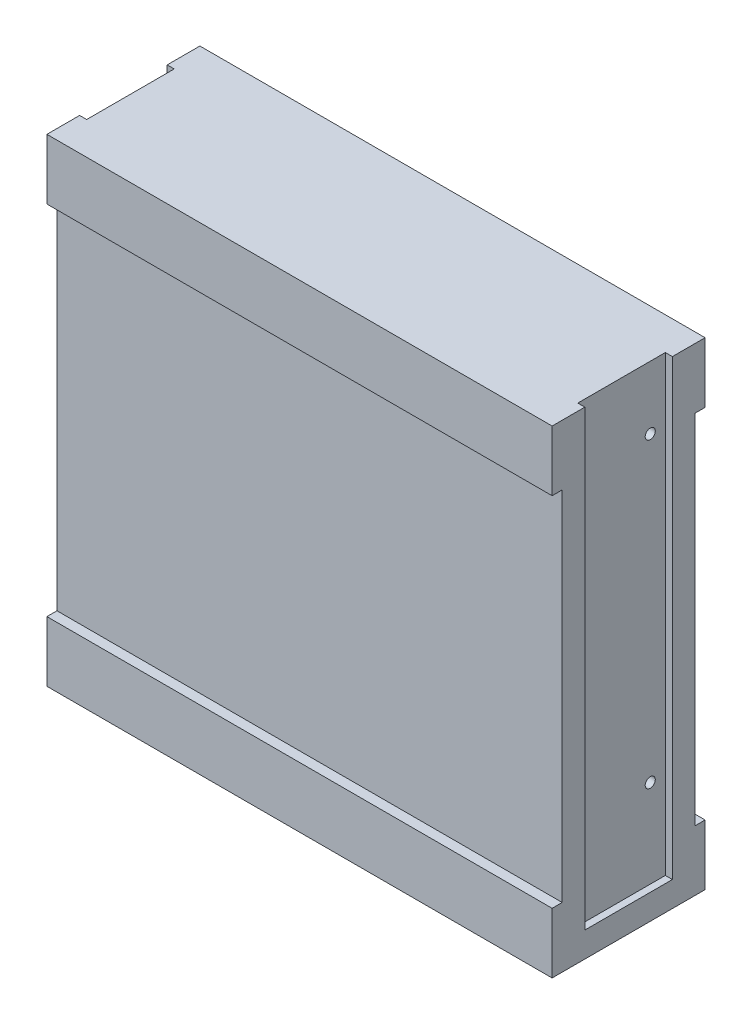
ISO-10303-21;
HEADER;
FILE_DESCRIPTION(('STEP AP214'),'2;1');
FILE_NAME('part.step','',(''),(''),'','','');
FILE_SCHEMA(('AUTOMOTIVE_DESIGN { 1 0 10303 214 1 1 1 1 }'));
ENDSEC;
DATA;
#1=APPLICATION_CONTEXT('core data for automotive mechanical design processes');
#2=APPLICATION_PROTOCOL_DEFINITION('international standard','automotive_design',2000,#1);
#3=PRODUCT_CONTEXT('',#1,'mechanical');
#4=PRODUCT('Part','Part','',(#3));
#5=PRODUCT_RELATED_PRODUCT_CATEGORY('part','',(#4));
#6=PRODUCT_DEFINITION_FORMATION('','',#4);
#7=PRODUCT_DEFINITION_CONTEXT('part definition',#1,'design');
#8=PRODUCT_DEFINITION('design','',#6,#7);
#9=PRODUCT_DEFINITION_SHAPE('','',#8);
#10=(LENGTH_UNIT() NAMED_UNIT(*) SI_UNIT(.MILLI.,.METRE.));
#11=(NAMED_UNIT(*) PLANE_ANGLE_UNIT() SI_UNIT($,.RADIAN.));
#12=(NAMED_UNIT(*) SI_UNIT($,.STERADIAN.) SOLID_ANGLE_UNIT());
#13=UNCERTAINTY_MEASURE_WITH_UNIT(LENGTH_MEASURE(1.E-05),#10,'distance_accuracy_value','');
#14=(GEOMETRIC_REPRESENTATION_CONTEXT(3) GLOBAL_UNCERTAINTY_ASSIGNED_CONTEXT((#13)) GLOBAL_UNIT_ASSIGNED_CONTEXT((#10,
#11,#12)) REPRESENTATION_CONTEXT('',''));
#15=CARTESIAN_POINT('',(0.,0.,0.));
#16=DIRECTION('',(0.,0.,1.));
#17=DIRECTION('',(1.,0.,0.));
#18=AXIS2_PLACEMENT_3D('',#15,#16,#17);
#19=CARTESIAN_POINT('',(0.,0.,0.));
#20=DIRECTION('',(0.,0.,1.));
#21=DIRECTION('',(1.,0.,0.));
#22=AXIS2_PLACEMENT_3D('',#19,#20,#21);
#23=PLANE('',#22);
#24=DIRECTION('',(0.,-1.,0.));
#25=VECTOR('',#24,1.);
#26=CARTESIAN_POINT('',(-136.451219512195,43.1006097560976,0.));
#27=LINE('',#26,#25);
#28=CARTESIAN_POINT('',(-136.451219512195,-39.8993902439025,0.));
#29=VERTEX_POINT('',#28);
#30=CARTESIAN_POINT('',(-136.451219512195,-51.8993902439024,0.));
#31=VERTEX_POINT('',#30);
#32=EDGE_CURVE('E290',#29,#31,#27,.T.);
#33=ORIENTED_EDGE('',*,*,#32,.F.);
#34=DIRECTION('',(1.,0.,0.));
#35=VECTOR('',#34,1.);
#36=CARTESIAN_POINT('',(-207.479382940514,-39.8993902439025,0.));
#37=LINE('',#36,#35);
#38=CARTESIAN_POINT('',(-36.0512195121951,-39.8993902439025,0.));
#39=VERTEX_POINT('',#38);
#40=EDGE_CURVE('E248',#29,#39,#37,.T.);
#41=ORIENTED_EDGE('',*,*,#40,.T.);
#42=DIRECTION('',(0.,1.,0.));
#43=VECTOR('',#42,1.);
#44=CARTESIAN_POINT('',(-36.0512195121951,43.1006097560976,0.));
#45=LINE('',#44,#43);
#46=CARTESIAN_POINT('',(-36.0512195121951,-51.8993902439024,0.));
#47=VERTEX_POINT('',#46);
#48=EDGE_CURVE('E310',#47,#39,#45,.T.);
#49=ORIENTED_EDGE('',*,*,#48,.F.);
#50=DIRECTION('',(1.,0.,0.));
#51=VECTOR('',#50,1.);
#52=CARTESIAN_POINT('',(-136.451219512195,-51.8993902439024,0.));
#53=LINE('',#52,#51);
#54=EDGE_CURVE('E307',#31,#47,#53,.T.);
#55=ORIENTED_EDGE('',*,*,#54,.F.);
#56=EDGE_LOOP('',(#33,#41,#49,#55));
#57=FACE_BOUND('',#56,.T.);
#58=ADVANCED_FACE('F35',(#57),#23,.F.);
#59=CARTESIAN_POINT('',(0.,0.,30.4));
#60=DIRECTION('',(0.,0.,1.));
#61=DIRECTION('',(1.,0.,0.));
#62=AXIS2_PLACEMENT_3D('',#59,#60,#61);
#63=PLANE('',#62);
#64=DIRECTION('',(1.,0.,0.));
#65=VECTOR('',#64,1.);
#66=CARTESIAN_POINT('',(-207.479382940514,31.1006097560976,30.4));
#67=LINE('',#66,#65);
#68=CARTESIAN_POINT('',(-136.451219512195,31.1006097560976,30.4));
#69=VERTEX_POINT('',#68);
#70=CARTESIAN_POINT('',(-36.0512195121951,31.1006097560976,30.4));
#71=VERTEX_POINT('',#70);
#72=EDGE_CURVE('E271',#69,#71,#67,.T.);
#73=ORIENTED_EDGE('',*,*,#72,.T.);
#74=DIRECTION('',(0.,1.,0.));
#75=VECTOR('',#74,1.);
#76=CARTESIAN_POINT('',(-36.0512195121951,43.1006097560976,30.4));
#77=LINE('',#76,#75);
#78=CARTESIAN_POINT('',(-36.0512195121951,43.1006097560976,30.4));
#79=VERTEX_POINT('',#78);
#80=EDGE_CURVE('E297',#71,#79,#77,.T.);
#81=ORIENTED_EDGE('',*,*,#80,.T.);
#82=DIRECTION('',(-1.,0.,0.));
#83=VECTOR('',#82,1.);
#84=CARTESIAN_POINT('',(-136.451219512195,43.1006097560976,30.4));
#85=LINE('',#84,#83);
#86=CARTESIAN_POINT('',(-136.451219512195,43.1006097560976,30.4));
#87=VERTEX_POINT('',#86);
#88=EDGE_CURVE('E301',#79,#87,#85,.T.);
#89=ORIENTED_EDGE('',*,*,#88,.T.);
#90=DIRECTION('',(0.,-1.,0.));
#91=VECTOR('',#90,1.);
#92=CARTESIAN_POINT('',(-136.451219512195,43.1006097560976,30.4));
#93=LINE('',#92,#91);
#94=EDGE_CURVE('E291',#87,#69,#93,.T.);
#95=ORIENTED_EDGE('',*,*,#94,.T.);
#96=EDGE_LOOP('',(#73,#81,#89,#95));
#97=FACE_BOUND('',#96,.T.);
#98=ADVANCED_FACE('F354',(#97),#63,.T.);
#99=CARTESIAN_POINT('',(-136.451219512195,43.1006097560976,30.4));
#100=DIRECTION('',(1.,0.,0.));
#101=DIRECTION('',(0.,0.,-1.));
#102=AXIS2_PLACEMENT_3D('',#99,#100,#101);
#103=PLANE('',#102);
#104=DIRECTION('',(0.,0.,-1.));
#105=VECTOR('',#104,1.);
#106=CARTESIAN_POINT('',(-136.451219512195,43.1006097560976,30.4));
#107=LINE('',#106,#105);
#108=CARTESIAN_POINT('',(-136.451219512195,43.1006097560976,23.9));
#109=VERTEX_POINT('',#108);
#110=EDGE_CURVE('E316',#87,#109,#107,.T.);
#111=ORIENTED_EDGE('',*,*,#110,.T.);
#112=DIRECTION('',(0.,1.,0.));
#113=VECTOR('',#112,1.);
#114=CARTESIAN_POINT('',(-136.451219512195,43.1006097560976,23.9));
#115=LINE('',#114,#113);
#116=CARTESIAN_POINT('',(-136.451219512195,-46.8993902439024,23.9));
#117=VERTEX_POINT('',#116);
#118=EDGE_CURVE('E215',#117,#109,#115,.T.);
#119=ORIENTED_EDGE('',*,*,#118,.F.);
#120=DIRECTION('',(0.,0.,1.));
#121=VECTOR('',#120,1.);
#122=CARTESIAN_POINT('',(-136.451219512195,-46.8993902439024,23.9));
#123=LINE('',#122,#121);
#124=CARTESIAN_POINT('',(-136.451219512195,-46.8993902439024,6.50000000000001));
#125=VERTEX_POINT('',#124);
#126=EDGE_CURVE('E218',#125,#117,#123,.T.);
#127=ORIENTED_EDGE('',*,*,#126,.F.);
#128=DIRECTION('',(0.,-1.,0.));
#129=VECTOR('',#128,1.);
#130=CARTESIAN_POINT('',(-136.451219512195,43.1006097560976,6.5));
#131=LINE('',#130,#129);
#132=CARTESIAN_POINT('',(-136.451219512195,43.1006097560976,6.5));
#133=VERTEX_POINT('',#132);
#134=EDGE_CURVE('E227',#133,#125,#131,.T.);
#135=ORIENTED_EDGE('',*,*,#134,.F.);
#136=CARTESIAN_POINT('',(-136.451219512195,43.1006097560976,0.));
#137=VERTEX_POINT('',#136);
#138=EDGE_CURVE('E303',#133,#137,#107,.T.);
#139=ORIENTED_EDGE('',*,*,#138,.T.);
#140=CARTESIAN_POINT('',(-136.451219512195,31.1006097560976,0.));
#141=VERTEX_POINT('',#140);
#142=EDGE_CURVE('E304',#137,#141,#27,.T.);
#143=ORIENTED_EDGE('',*,*,#142,.T.);
#144=DIRECTION('',(0.,0.,-1.));
#145=VECTOR('',#144,1.);
#146=CARTESIAN_POINT('',(-136.451219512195,31.1006097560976,0.));
#147=LINE('',#146,#145);
#148=CARTESIAN_POINT('',(-136.451219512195,31.1006097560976,2.));
#149=VERTEX_POINT('',#148);
#150=EDGE_CURVE('E250',#149,#141,#147,.T.);
#151=ORIENTED_EDGE('',*,*,#150,.F.);
#152=DIRECTION('',(0.,1.,0.));
#153=VECTOR('',#152,1.);
#154=CARTESIAN_POINT('',(-136.451219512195,-39.8993902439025,2.));
#155=LINE('',#154,#153);
#156=CARTESIAN_POINT('',(-136.451219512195,-39.8993902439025,2.));
#157=VERTEX_POINT('',#156);
#158=EDGE_CURVE('E245',#157,#149,#155,.T.);
#159=ORIENTED_EDGE('',*,*,#158,.F.);
#160=DIRECTION('',(0.,0.,1.));
#161=VECTOR('',#160,1.);
#162=CARTESIAN_POINT('',(-136.451219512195,-39.8993902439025,0.));
#163=LINE('',#162,#161);
#164=EDGE_CURVE('E247',#29,#157,#163,.T.);
#165=ORIENTED_EDGE('',*,*,#164,.F.);
#166=ORIENTED_EDGE('',*,*,#32,.T.);
#167=DIRECTION('',(0.,0.,-1.));
#168=VECTOR('',#167,1.);
#169=CARTESIAN_POINT('',(-136.451219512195,-51.8993902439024,30.4));
#170=LINE('',#169,#168);
#171=CARTESIAN_POINT('',(-136.451219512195,-51.8993902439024,30.4));
#172=VERTEX_POINT('',#171);
#173=EDGE_CURVE('E11',#172,#31,#170,.T.);
#174=ORIENTED_EDGE('',*,*,#173,.F.);
#175=CARTESIAN_POINT('',(-136.451219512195,-39.8993902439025,30.4));
#176=VERTEX_POINT('',#175);
#177=EDGE_CURVE('E295',#176,#172,#93,.T.);
#178=ORIENTED_EDGE('',*,*,#177,.F.);
#179=DIRECTION('',(0.,0.,1.));
#180=VECTOR('',#179,1.);
#181=CARTESIAN_POINT('',(-136.451219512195,-39.8993902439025,30.4));
#182=LINE('',#181,#180);
#183=CARTESIAN_POINT('',(-136.451219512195,-39.8993902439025,28.4));
#184=VERTEX_POINT('',#183);
#185=EDGE_CURVE('E273',#184,#176,#182,.T.);
#186=ORIENTED_EDGE('',*,*,#185,.F.);
#187=DIRECTION('',(0.,-1.,0.));
#188=VECTOR('',#187,1.);
#189=CARTESIAN_POINT('',(-136.451219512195,-39.8993902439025,28.4));
#190=LINE('',#189,#188);
#191=CARTESIAN_POINT('',(-136.451219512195,31.1006097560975,28.4));
#192=VERTEX_POINT('',#191);
#193=EDGE_CURVE('E268',#192,#184,#190,.T.);
#194=ORIENTED_EDGE('',*,*,#193,.F.);
#195=DIRECTION('',(0.,0.,-1.));
#196=VECTOR('',#195,1.);
#197=CARTESIAN_POINT('',(-136.451219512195,31.1006097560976,30.4));
#198=LINE('',#197,#196);
#199=EDGE_CURVE('E270',#69,#192,#198,.T.);
#200=ORIENTED_EDGE('',*,*,#199,.F.);
#201=ORIENTED_EDGE('',*,*,#94,.F.);
#202=EDGE_LOOP('',(#111,#119,#127,#135,#139,#143,#151,#159,#165,#166,#174,#178,#186,#194,#200,#201));
#203=FACE_BOUND('',#202,.T.);
#204=ADVANCED_FACE('F37',(#203),#103,.F.);
#205=CARTESIAN_POINT('',(-136.451219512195,-51.8993902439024,30.4));
#206=DIRECTION('',(0.,1.,0.));
#207=DIRECTION('',(0.,0.,1.));
#208=AXIS2_PLACEMENT_3D('',#205,#206,#207);
#209=PLANE('',#208);
#210=ORIENTED_EDGE('',*,*,#54,.T.);
#211=DIRECTION('',(0.,0.,-1.));
#212=VECTOR('',#211,1.);
#213=CARTESIAN_POINT('',(-36.0512195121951,-51.8993902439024,30.4));
#214=LINE('',#213,#212);
#215=CARTESIAN_POINT('',(-36.0512195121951,-51.8993902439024,30.4));
#216=VERTEX_POINT('',#215);
#217=EDGE_CURVE('E44',#216,#47,#214,.T.);
#218=ORIENTED_EDGE('',*,*,#217,.F.);
#219=DIRECTION('',(1.,0.,0.));
#220=VECTOR('',#219,1.);
#221=CARTESIAN_POINT('',(-136.451219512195,-51.8993902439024,30.4));
#222=LINE('',#221,#220);
#223=EDGE_CURVE('E294',#172,#216,#222,.T.);
#224=ORIENTED_EDGE('',*,*,#223,.F.);
#225=ORIENTED_EDGE('',*,*,#173,.T.);
#226=EDGE_LOOP('',(#210,#218,#224,#225));
#227=FACE_BOUND('',#226,.T.);
#228=ADVANCED_FACE('F368',(#227),#209,.F.);
#229=CARTESIAN_POINT('',(-36.0512195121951,43.1006097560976,30.4));
#230=DIRECTION('',(-1.,0.,0.));
#231=DIRECTION('',(0.,-1.,0.));
#232=AXIS2_PLACEMENT_3D('',#229,#230,#231);
#233=PLANE('',#232);
#234=DIRECTION('',(0.,0.,-1.));
#235=VECTOR('',#234,1.);
#236=CARTESIAN_POINT('',(-36.0512195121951,-46.8993902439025,23.9));
#237=LINE('',#236,#235);
#238=CARTESIAN_POINT('',(-36.0512195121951,-46.8993902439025,23.9));
#239=VERTEX_POINT('',#238);
#240=CARTESIAN_POINT('',(-36.0512195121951,-46.8993902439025,6.50000000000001));
#241=VERTEX_POINT('',#240);
#242=EDGE_CURVE('E199',#239,#241,#237,.T.);
#243=ORIENTED_EDGE('',*,*,#242,.F.);
#244=DIRECTION('',(0.,-1.,0.));
#245=VECTOR('',#244,1.);
#246=CARTESIAN_POINT('',(-36.0512195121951,-46.8993902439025,23.9));
#247=LINE('',#246,#245);
#248=CARTESIAN_POINT('',(-36.0512195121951,43.1006097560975,23.9));
#249=VERTEX_POINT('',#248);
#250=EDGE_CURVE('E183',#249,#239,#247,.T.);
#251=ORIENTED_EDGE('',*,*,#250,.F.);
#252=DIRECTION('',(0.,0.,-1.));
#253=VECTOR('',#252,1.);
#254=CARTESIAN_POINT('',(-36.0512195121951,43.1006097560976,30.4));
#255=LINE('',#254,#253);
#256=EDGE_CURVE('E320',#79,#249,#255,.T.);
#257=ORIENTED_EDGE('',*,*,#256,.F.);
#258=ORIENTED_EDGE('',*,*,#80,.F.);
#259=DIRECTION('',(0.,0.,1.));
#260=VECTOR('',#259,1.);
#261=CARTESIAN_POINT('',(-36.0512195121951,31.1006097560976,30.4));
#262=LINE('',#261,#260);
#263=CARTESIAN_POINT('',(-36.0512195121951,31.1006097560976,28.4));
#264=VERTEX_POINT('',#263);
#265=EDGE_CURVE('E279',#264,#71,#262,.T.);
#266=ORIENTED_EDGE('',*,*,#265,.F.);
#267=DIRECTION('',(0.,1.,0.));
#268=VECTOR('',#267,1.);
#269=CARTESIAN_POINT('',(-36.0512195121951,-39.8993902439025,28.4));
#270=LINE('',#269,#268);
#271=CARTESIAN_POINT('',(-36.0512195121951,-39.8993902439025,28.4));
#272=VERTEX_POINT('',#271);
#273=EDGE_CURVE('E276',#272,#264,#270,.T.);
#274=ORIENTED_EDGE('',*,*,#273,.F.);
#275=DIRECTION('',(0.,0.,-1.));
#276=VECTOR('',#275,1.);
#277=CARTESIAN_POINT('',(-36.0512195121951,-39.8993902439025,30.4));
#278=LINE('',#277,#276);
#279=CARTESIAN_POINT('',(-36.0512195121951,-39.8993902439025,30.4));
#280=VERTEX_POINT('',#279);
#281=EDGE_CURVE('E267',#280,#272,#278,.T.);
#282=ORIENTED_EDGE('',*,*,#281,.F.);
#283=EDGE_CURVE('E298',#216,#280,#77,.T.);
#284=ORIENTED_EDGE('',*,*,#283,.F.);
#285=ORIENTED_EDGE('',*,*,#217,.T.);
#286=ORIENTED_EDGE('',*,*,#48,.T.);
#287=DIRECTION('',(0.,0.,-1.));
#288=VECTOR('',#287,1.);
#289=CARTESIAN_POINT('',(-36.0512195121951,-39.8993902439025,0.));
#290=LINE('',#289,#288);
#291=CARTESIAN_POINT('',(-36.0512195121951,-39.8993902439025,2.));
#292=VERTEX_POINT('',#291);
#293=EDGE_CURVE('E256',#292,#39,#290,.T.);
#294=ORIENTED_EDGE('',*,*,#293,.F.);
#295=DIRECTION('',(0.,-1.,0.));
#296=VECTOR('',#295,1.);
#297=CARTESIAN_POINT('',(-36.0512195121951,-39.8993902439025,2.));
#298=LINE('',#297,#296);
#299=CARTESIAN_POINT('',(-36.0512195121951,31.1006097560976,2.));
#300=VERTEX_POINT('',#299);
#301=EDGE_CURVE('E253',#300,#292,#298,.T.);
#302=ORIENTED_EDGE('',*,*,#301,.F.);
#303=DIRECTION('',(0.,0.,1.));
#304=VECTOR('',#303,1.);
#305=CARTESIAN_POINT('',(-36.0512195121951,31.1006097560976,0.));
#306=LINE('',#305,#304);
#307=CARTESIAN_POINT('',(-36.0512195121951,31.1006097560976,0.));
#308=VERTEX_POINT('',#307);
#309=EDGE_CURVE('E244',#308,#300,#306,.T.);
#310=ORIENTED_EDGE('',*,*,#309,.F.);
#311=CARTESIAN_POINT('',(-36.0512195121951,43.1006097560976,0.));
#312=VERTEX_POINT('',#311);
#313=EDGE_CURVE('E309',#308,#312,#45,.T.);
#314=ORIENTED_EDGE('',*,*,#313,.T.);
#315=CARTESIAN_POINT('',(-36.0512195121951,43.1006097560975,6.50000000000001));
#316=VERTEX_POINT('',#315);
#317=EDGE_CURVE('E319',#316,#312,#255,.T.);
#318=ORIENTED_EDGE('',*,*,#317,.F.);
#319=DIRECTION('',(0.,1.,0.));
#320=VECTOR('',#319,1.);
#321=CARTESIAN_POINT('',(-36.0512195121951,-46.8993902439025,6.50000000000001));
#322=LINE('',#321,#320);
#323=EDGE_CURVE('E197',#241,#316,#322,.T.);
#324=ORIENTED_EDGE('',*,*,#323,.F.);
#325=EDGE_LOOP('',(#243,#251,#257,#258,#266,#274,#282,#284,#285,#286,#294,#302,#310,#314,#318,#324));
#326=FACE_BOUND('',#325,.T.);
#327=ADVANCED_FACE('F365',(#326),#233,.F.);
#328=CARTESIAN_POINT('',(-136.451219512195,43.1006097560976,30.4));
#329=DIRECTION('',(0.,-1.,0.));
#330=DIRECTION('',(0.,0.,-1.));
#331=AXIS2_PLACEMENT_3D('',#328,#329,#330);
#332=PLANE('',#331);
#333=ORIENTED_EDGE('',*,*,#256,.T.);
#334=DIRECTION('',(1.,0.,0.));
#335=VECTOR('',#334,1.);
#336=CARTESIAN_POINT('',(-37.4512195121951,43.1006097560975,23.9));
#337=LINE('',#336,#335);
#338=CARTESIAN_POINT('',(-37.4512195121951,43.1006097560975,23.9));
#339=VERTEX_POINT('',#338);
#340=EDGE_CURVE('E206',#339,#249,#337,.T.);
#341=ORIENTED_EDGE('',*,*,#340,.F.);
#342=DIRECTION('',(0.,0.,1.));
#343=VECTOR('',#342,1.);
#344=CARTESIAN_POINT('',(-37.4512195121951,43.1006097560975,23.9));
#345=LINE('',#344,#343);
#346=CARTESIAN_POINT('',(-37.4512195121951,43.1006097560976,6.50000000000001));
#347=VERTEX_POINT('',#346);
#348=EDGE_CURVE('E188',#347,#339,#345,.T.);
#349=ORIENTED_EDGE('',*,*,#348,.F.);
#350=DIRECTION('',(1.,0.,0.));
#351=VECTOR('',#350,1.);
#352=CARTESIAN_POINT('',(-37.4512195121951,43.1006097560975,6.50000000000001));
#353=LINE('',#352,#351);
#354=EDGE_CURVE('E208',#347,#316,#353,.T.);
#355=ORIENTED_EDGE('',*,*,#354,.T.);
#356=ORIENTED_EDGE('',*,*,#317,.T.);
#357=DIRECTION('',(-1.,0.,0.));
#358=VECTOR('',#357,1.);
#359=CARTESIAN_POINT('',(-136.451219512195,43.1006097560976,0.));
#360=LINE('',#359,#358);
#361=EDGE_CURVE('E313',#312,#137,#360,.T.);
#362=ORIENTED_EDGE('',*,*,#361,.T.);
#363=ORIENTED_EDGE('',*,*,#138,.F.);
#364=DIRECTION('',(-1.,0.,0.));
#365=VECTOR('',#364,1.);
#366=CARTESIAN_POINT('',(-135.051219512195,43.1006097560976,6.5));
#367=LINE('',#366,#365);
#368=CARTESIAN_POINT('',(-135.051219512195,43.1006097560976,6.5));
#369=VERTEX_POINT('',#368);
#370=EDGE_CURVE('E237',#369,#133,#367,.T.);
#371=ORIENTED_EDGE('',*,*,#370,.F.);
#372=DIRECTION('',(0.,0.,-1.));
#373=VECTOR('',#372,1.);
#374=CARTESIAN_POINT('',(-135.051219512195,43.1006097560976,23.9));
#375=LINE('',#374,#373);
#376=CARTESIAN_POINT('',(-135.051219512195,43.1006097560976,23.9));
#377=VERTEX_POINT('',#376);
#378=EDGE_CURVE('E217',#377,#369,#375,.T.);
#379=ORIENTED_EDGE('',*,*,#378,.F.);
#380=DIRECTION('',(-1.,0.,0.));
#381=VECTOR('',#380,1.);
#382=CARTESIAN_POINT('',(-135.051219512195,43.1006097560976,23.9));
#383=LINE('',#382,#381);
#384=EDGE_CURVE('E225',#377,#109,#383,.T.);
#385=ORIENTED_EDGE('',*,*,#384,.T.);
#386=ORIENTED_EDGE('',*,*,#110,.F.);
#387=ORIENTED_EDGE('',*,*,#88,.F.);
#388=EDGE_LOOP('',(#333,#341,#349,#355,#356,#362,#363,#371,#379,#385,#386,#387));
#389=FACE_BOUND('',#388,.T.);
#390=ADVANCED_FACE('F362',(#389),#332,.F.);
#391=DIRECTION('',(1.,0.,0.));
#392=VECTOR('',#391,1.);
#393=CARTESIAN_POINT('',(-207.479382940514,-39.8993902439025,30.4));
#394=LINE('',#393,#392);
#395=EDGE_CURVE('E281',#176,#280,#394,.T.);
#396=ORIENTED_EDGE('',*,*,#395,.F.);
#397=ORIENTED_EDGE('',*,*,#177,.T.);
#398=ORIENTED_EDGE('',*,*,#223,.T.);
#399=ORIENTED_EDGE('',*,*,#283,.T.);
#400=EDGE_LOOP('',(#396,#397,#398,#399));
#401=FACE_BOUND('',#400,.T.);
#402=ADVANCED_FACE('F349',(#401),#63,.T.);
#403=ORIENTED_EDGE('',*,*,#313,.F.);
#404=DIRECTION('',(1.,0.,0.));
#405=VECTOR('',#404,1.);
#406=CARTESIAN_POINT('',(-207.479382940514,31.1006097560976,0.));
#407=LINE('',#406,#405);
#408=EDGE_CURVE('E258',#141,#308,#407,.T.);
#409=ORIENTED_EDGE('',*,*,#408,.F.);
#410=ORIENTED_EDGE('',*,*,#142,.F.);
#411=ORIENTED_EDGE('',*,*,#361,.F.);
#412=EDGE_LOOP('',(#403,#409,#410,#411));
#413=FACE_BOUND('',#412,.T.);
#414=ADVANCED_FACE('F339',(#413),#23,.F.);
#415=CARTESIAN_POINT('',(-139.279646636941,-29.3993902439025,9.5));
#416=DIRECTION('',(1.,0.,0.));
#417=DIRECTION('',(0.,0.,-1.));
#418=AXIS2_PLACEMENT_3D('',#415,#416,#417);
#419=CYLINDRICAL_SURFACE('',#418,1.);
#420=CARTESIAN_POINT('',(-37.4512195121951,-29.3993902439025,9.5));
#421=DIRECTION('',(-1.,0.,0.));
#422=DIRECTION('',(0.,0.,1.));
#423=AXIS2_PLACEMENT_3D('',#420,#421,#422);
#424=CIRCLE('',#423,1.);
#425=CARTESIAN_POINT('',(-37.4512195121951,-29.3993902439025,10.5));
#426=VERTEX_POINT('',#425);
#427=EDGE_CURVE('E212',#426,#426,#424,.F.);
#428=ORIENTED_EDGE('',*,*,#427,.T.);
#429=EDGE_LOOP('',(#428));
#430=FACE_BOUND('',#429,.T.);
#431=CARTESIAN_POINT('',(-135.051219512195,-29.3993902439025,9.5));
#432=DIRECTION('',(1.,0.,0.));
#433=DIRECTION('',(0.,0.,-1.));
#434=AXIS2_PLACEMENT_3D('',#431,#432,#433);
#435=CIRCLE('',#434,1.);
#436=CARTESIAN_POINT('',(-135.051219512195,-29.3993902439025,8.5));
#437=VERTEX_POINT('',#436);
#438=EDGE_CURVE('E241',#437,#437,#435,.F.);
#439=ORIENTED_EDGE('',*,*,#438,.T.);
#440=EDGE_LOOP('',(#439));
#441=FACE_BOUND('',#440,.T.);
#442=ADVANCED_FACE('F337',(#430,#441),#419,.F.);
#443=CARTESIAN_POINT('',(-139.279646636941,30.6006097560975,9.5));
#444=DIRECTION('',(1.,0.,0.));
#445=DIRECTION('',(0.,0.,-1.));
#446=AXIS2_PLACEMENT_3D('',#443,#444,#445);
#447=CYLINDRICAL_SURFACE('',#446,1.);
#448=CARTESIAN_POINT('',(-37.4512195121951,30.6006097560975,9.5));
#449=DIRECTION('',(-1.,0.,0.));
#450=DIRECTION('',(0.,0.,1.));
#451=AXIS2_PLACEMENT_3D('',#448,#449,#450);
#452=CIRCLE('',#451,1.);
#453=CARTESIAN_POINT('',(-37.4512195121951,30.6006097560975,10.5));
#454=VERTEX_POINT('',#453);
#455=EDGE_CURVE('E39',#454,#454,#452,.F.);
#456=ORIENTED_EDGE('',*,*,#455,.T.);
#457=EDGE_LOOP('',(#456));
#458=FACE_BOUND('',#457,.T.);
#459=CARTESIAN_POINT('',(-135.051219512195,30.6006097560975,9.5));
#460=DIRECTION('',(1.,0.,0.));
#461=DIRECTION('',(0.,0.,-1.));
#462=AXIS2_PLACEMENT_3D('',#459,#460,#461);
#463=CIRCLE('',#462,1.);
#464=CARTESIAN_POINT('',(-135.051219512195,30.6006097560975,8.5));
#465=VERTEX_POINT('',#464);
#466=EDGE_CURVE('E234',#465,#465,#463,.F.);
#467=ORIENTED_EDGE('',*,*,#466,.T.);
#468=EDGE_LOOP('',(#467));
#469=FACE_BOUND('',#468,.T.);
#470=ADVANCED_FACE('F327',(#458,#469),#447,.F.);
#471=CARTESIAN_POINT('',(-207.479382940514,31.1006097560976,30.4));
#472=DIRECTION('',(0.,1.,0.));
#473=DIRECTION('',(0.,0.,1.));
#474=AXIS2_PLACEMENT_3D('',#471,#472,#473);
#475=PLANE('',#474);
#476=ORIENTED_EDGE('',*,*,#199,.T.);
#477=DIRECTION('',(1.,0.,0.));
#478=VECTOR('',#477,1.);
#479=CARTESIAN_POINT('',(-207.479382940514,31.1006097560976,28.4));
#480=LINE('',#479,#478);
#481=EDGE_CURVE('E284',#192,#264,#480,.T.);
#482=ORIENTED_EDGE('',*,*,#481,.T.);
#483=ORIENTED_EDGE('',*,*,#265,.T.);
#484=ORIENTED_EDGE('',*,*,#72,.F.);
#485=EDGE_LOOP('',(#476,#482,#483,#484));
#486=FACE_BOUND('',#485,.T.);
#487=ADVANCED_FACE('F346',(#486),#475,.F.);
#488=CARTESIAN_POINT('',(-207.479382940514,-39.8993902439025,28.4));
#489=DIRECTION('',(0.,0.,-1.));
#490=DIRECTION('',(0.,1.,0.));
#491=AXIS2_PLACEMENT_3D('',#488,#489,#490);
#492=PLANE('',#491);
#493=ORIENTED_EDGE('',*,*,#193,.T.);
#494=DIRECTION('',(1.,0.,0.));
#495=VECTOR('',#494,1.);
#496=CARTESIAN_POINT('',(-207.479382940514,-39.8993902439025,28.4));
#497=LINE('',#496,#495);
#498=EDGE_CURVE('E286',#184,#272,#497,.T.);
#499=ORIENTED_EDGE('',*,*,#498,.T.);
#500=ORIENTED_EDGE('',*,*,#273,.T.);
#501=ORIENTED_EDGE('',*,*,#481,.F.);
#502=EDGE_LOOP('',(#493,#499,#500,#501));
#503=FACE_BOUND('',#502,.T.);
#504=ADVANCED_FACE('F421',(#503),#492,.F.);
#505=CARTESIAN_POINT('',(-207.479382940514,-39.8993902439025,30.4));
#506=DIRECTION('',(0.,-1.,0.));
#507=DIRECTION('',(0.,0.,-1.));
#508=AXIS2_PLACEMENT_3D('',#505,#506,#507);
#509=PLANE('',#508);
#510=ORIENTED_EDGE('',*,*,#185,.T.);
#511=ORIENTED_EDGE('',*,*,#395,.T.);
#512=ORIENTED_EDGE('',*,*,#281,.T.);
#513=ORIENTED_EDGE('',*,*,#498,.F.);
#514=EDGE_LOOP('',(#510,#511,#512,#513));
#515=FACE_BOUND('',#514,.T.);
#516=ADVANCED_FACE('F423',(#515),#509,.F.);
#517=CARTESIAN_POINT('',(-207.479382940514,-39.8993902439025,0.));
#518=DIRECTION('',(0.,-1.,0.));
#519=DIRECTION('',(0.,0.,-1.));
#520=AXIS2_PLACEMENT_3D('',#517,#518,#519);
#521=PLANE('',#520);
#522=ORIENTED_EDGE('',*,*,#164,.T.);
#523=DIRECTION('',(1.,0.,0.));
#524=VECTOR('',#523,1.);
#525=CARTESIAN_POINT('',(-207.479382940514,-39.8993902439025,2.));
#526=LINE('',#525,#524);
#527=EDGE_CURVE('E261',#157,#292,#526,.T.);
#528=ORIENTED_EDGE('',*,*,#527,.T.);
#529=ORIENTED_EDGE('',*,*,#293,.T.);
#530=ORIENTED_EDGE('',*,*,#40,.F.);
#531=EDGE_LOOP('',(#522,#528,#529,#530));
#532=FACE_BOUND('',#531,.T.);
#533=ADVANCED_FACE('F386',(#532),#521,.F.);
#534=CARTESIAN_POINT('',(-207.479382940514,-39.8993902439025,2.));
#535=DIRECTION('',(0.,0.,1.));
#536=DIRECTION('',(1.,0.,0.));
#537=AXIS2_PLACEMENT_3D('',#534,#535,#536);
#538=PLANE('',#537);
#539=ORIENTED_EDGE('',*,*,#158,.T.);
#540=DIRECTION('',(1.,0.,0.));
#541=VECTOR('',#540,1.);
#542=CARTESIAN_POINT('',(-207.479382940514,31.1006097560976,2.));
#543=LINE('',#542,#541);
#544=EDGE_CURVE('E263',#149,#300,#543,.T.);
#545=ORIENTED_EDGE('',*,*,#544,.T.);
#546=ORIENTED_EDGE('',*,*,#301,.T.);
#547=ORIENTED_EDGE('',*,*,#527,.F.);
#548=EDGE_LOOP('',(#539,#545,#546,#547));
#549=FACE_BOUND('',#548,.T.);
#550=ADVANCED_FACE('F392',(#549),#538,.F.);
#551=CARTESIAN_POINT('',(-207.479382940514,31.1006097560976,0.));
#552=DIRECTION('',(0.,1.,0.));
#553=DIRECTION('',(0.,0.,1.));
#554=AXIS2_PLACEMENT_3D('',#551,#552,#553);
#555=PLANE('',#554);
#556=ORIENTED_EDGE('',*,*,#150,.T.);
#557=ORIENTED_EDGE('',*,*,#408,.T.);
#558=ORIENTED_EDGE('',*,*,#309,.T.);
#559=ORIENTED_EDGE('',*,*,#544,.F.);
#560=EDGE_LOOP('',(#556,#557,#558,#559));
#561=FACE_BOUND('',#560,.T.);
#562=ADVANCED_FACE('F332',(#561),#555,.F.);
#563=CARTESIAN_POINT('',(-135.051219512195,0.,0.));
#564=DIRECTION('',(1.,0.,0.));
#565=DIRECTION('',(0.,0.,-1.));
#566=AXIS2_PLACEMENT_3D('',#563,#564,#565);
#567=PLANE('',#566);
#568=ORIENTED_EDGE('',*,*,#466,.F.);
#569=EDGE_LOOP('',(#568));
#570=FACE_BOUND('',#569,.T.);
#571=DIRECTION('',(0.,1.,0.));
#572=VECTOR('',#571,1.);
#573=CARTESIAN_POINT('',(-135.051219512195,43.1006097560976,23.9));
#574=LINE('',#573,#572);
#575=CARTESIAN_POINT('',(-135.051219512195,-46.8993902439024,23.9));
#576=VERTEX_POINT('',#575);
#577=EDGE_CURVE('E60',#576,#377,#574,.T.);
#578=ORIENTED_EDGE('',*,*,#577,.T.);
#579=ORIENTED_EDGE('',*,*,#378,.T.);
#580=DIRECTION('',(0.,-1.,0.));
#581=VECTOR('',#580,1.);
#582=CARTESIAN_POINT('',(-135.051219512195,43.1006097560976,6.5));
#583=LINE('',#582,#581);
#584=CARTESIAN_POINT('',(-135.051219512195,-46.8993902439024,6.50000000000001));
#585=VERTEX_POINT('',#584);
#586=EDGE_CURVE('E220',#369,#585,#583,.T.);
#587=ORIENTED_EDGE('',*,*,#586,.T.);
#588=DIRECTION('',(0.,0.,1.));
#589=VECTOR('',#588,1.);
#590=CARTESIAN_POINT('',(-135.051219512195,-46.8993902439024,23.9));
#591=LINE('',#590,#589);
#592=EDGE_CURVE('E223',#585,#576,#591,.T.);
#593=ORIENTED_EDGE('',*,*,#592,.T.);
#594=EDGE_LOOP('',(#578,#579,#587,#593));
#595=FACE_BOUND('',#594,.T.);
#596=ORIENTED_EDGE('',*,*,#438,.F.);
#597=EDGE_LOOP('',(#596));
#598=FACE_BOUND('',#597,.T.);
#599=ADVANCED_FACE('F329',(#570,#595,#598),#567,.F.);
#600=CARTESIAN_POINT('',(-135.051219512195,43.1006097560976,23.9));
#601=DIRECTION('',(0.,0.,1.));
#602=DIRECTION('',(0.,-1.,0.));
#603=AXIS2_PLACEMENT_3D('',#600,#601,#602);
#604=PLANE('',#603);
#605=ORIENTED_EDGE('',*,*,#118,.T.);
#606=ORIENTED_EDGE('',*,*,#384,.F.);
#607=ORIENTED_EDGE('',*,*,#577,.F.);
#608=DIRECTION('',(-1.,0.,0.));
#609=VECTOR('',#608,1.);
#610=CARTESIAN_POINT('',(-135.051219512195,-46.8993902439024,23.9));
#611=LINE('',#610,#609);
#612=EDGE_CURVE('E232',#576,#117,#611,.T.);
#613=ORIENTED_EDGE('',*,*,#612,.T.);
#614=EDGE_LOOP('',(#605,#606,#607,#613));
#615=FACE_BOUND('',#614,.T.);
#616=ADVANCED_FACE('F331',(#615),#604,.F.);
#617=CARTESIAN_POINT('',(-135.051219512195,-46.8993902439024,23.9));
#618=DIRECTION('',(0.,-1.,0.));
#619=DIRECTION('',(0.,0.,-1.));
#620=AXIS2_PLACEMENT_3D('',#617,#618,#619);
#621=PLANE('',#620);
#622=ORIENTED_EDGE('',*,*,#126,.T.);
#623=ORIENTED_EDGE('',*,*,#612,.F.);
#624=ORIENTED_EDGE('',*,*,#592,.F.);
#625=DIRECTION('',(-1.,0.,0.));
#626=VECTOR('',#625,1.);
#627=CARTESIAN_POINT('',(-135.051219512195,-46.8993902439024,6.50000000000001));
#628=LINE('',#627,#626);
#629=EDGE_CURVE('E235',#585,#125,#628,.T.);
#630=ORIENTED_EDGE('',*,*,#629,.T.);
#631=EDGE_LOOP('',(#622,#623,#624,#630));
#632=FACE_BOUND('',#631,.T.);
#633=ADVANCED_FACE('F512',(#632),#621,.F.);
#634=CARTESIAN_POINT('',(-135.051219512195,43.1006097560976,6.5));
#635=DIRECTION('',(0.,0.,-1.));
#636=DIRECTION('',(0.,1.,0.));
#637=AXIS2_PLACEMENT_3D('',#634,#635,#636);
#638=PLANE('',#637);
#639=ORIENTED_EDGE('',*,*,#134,.T.);
#640=ORIENTED_EDGE('',*,*,#629,.F.);
#641=ORIENTED_EDGE('',*,*,#586,.F.);
#642=ORIENTED_EDGE('',*,*,#370,.T.);
#643=EDGE_LOOP('',(#639,#640,#641,#642));
#644=FACE_BOUND('',#643,.T.);
#645=ADVANCED_FACE('F522',(#644),#638,.F.);
#646=CARTESIAN_POINT('',(-37.4512195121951,0.,0.));
#647=DIRECTION('',(-1.,0.,0.));
#648=DIRECTION('',(0.,0.,1.));
#649=AXIS2_PLACEMENT_3D('',#646,#647,#648);
#650=PLANE('',#649);
#651=ORIENTED_EDGE('',*,*,#455,.F.);
#652=EDGE_LOOP('',(#651));
#653=FACE_BOUND('',#652,.T.);
#654=DIRECTION('',(0.,-1.,0.));
#655=VECTOR('',#654,1.);
#656=CARTESIAN_POINT('',(-37.4512195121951,-46.8993902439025,23.9));
#657=LINE('',#656,#655);
#658=CARTESIAN_POINT('',(-37.4512195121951,-46.8993902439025,23.9));
#659=VERTEX_POINT('',#658);
#660=EDGE_CURVE('E181',#339,#659,#657,.T.);
#661=ORIENTED_EDGE('',*,*,#660,.T.);
#662=DIRECTION('',(0.,0.,-1.));
#663=VECTOR('',#662,1.);
#664=CARTESIAN_POINT('',(-37.4512195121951,-46.8993902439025,23.9));
#665=LINE('',#664,#663);
#666=CARTESIAN_POINT('',(-37.4512195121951,-46.8993902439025,6.50000000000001));
#667=VERTEX_POINT('',#666);
#668=EDGE_CURVE('E190',#659,#667,#665,.T.);
#669=ORIENTED_EDGE('',*,*,#668,.T.);
#670=DIRECTION('',(0.,1.,0.));
#671=VECTOR('',#670,1.);
#672=CARTESIAN_POINT('',(-37.4512195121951,-46.8993902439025,6.50000000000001));
#673=LINE('',#672,#671);
#674=EDGE_CURVE('E52',#667,#347,#673,.T.);
#675=ORIENTED_EDGE('',*,*,#674,.T.);
#676=ORIENTED_EDGE('',*,*,#348,.T.);
#677=EDGE_LOOP('',(#661,#669,#675,#676));
#678=FACE_BOUND('',#677,.T.);
#679=ORIENTED_EDGE('',*,*,#427,.F.);
#680=EDGE_LOOP('',(#679));
#681=FACE_BOUND('',#680,.T.);
#682=ADVANCED_FACE('F193',(#653,#678,#681),#650,.F.);
#683=CARTESIAN_POINT('',(-37.4512195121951,-46.8993902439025,23.9));
#684=DIRECTION('',(0.,0.,1.));
#685=DIRECTION('',(1.,0.,0.));
#686=AXIS2_PLACEMENT_3D('',#683,#684,#685);
#687=PLANE('',#686);
#688=ORIENTED_EDGE('',*,*,#250,.T.);
#689=DIRECTION('',(1.,0.,0.));
#690=VECTOR('',#689,1.);
#691=CARTESIAN_POINT('',(-37.4512195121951,-46.8993902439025,23.9));
#692=LINE('',#691,#690);
#693=EDGE_CURVE('E177',#659,#239,#692,.T.);
#694=ORIENTED_EDGE('',*,*,#693,.F.);
#695=ORIENTED_EDGE('',*,*,#660,.F.);
#696=ORIENTED_EDGE('',*,*,#340,.T.);
#697=EDGE_LOOP('',(#688,#694,#695,#696));
#698=FACE_BOUND('',#697,.T.);
#699=ADVANCED_FACE('F179',(#698),#687,.F.);
#700=CARTESIAN_POINT('',(-37.4512195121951,-46.8993902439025,6.50000000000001));
#701=DIRECTION('',(0.,0.,-1.));
#702=DIRECTION('',(-1.,0.,0.));
#703=AXIS2_PLACEMENT_3D('',#700,#701,#702);
#704=PLANE('',#703);
#705=ORIENTED_EDGE('',*,*,#323,.T.);
#706=ORIENTED_EDGE('',*,*,#354,.F.);
#707=ORIENTED_EDGE('',*,*,#674,.F.);
#708=DIRECTION('',(1.,0.,0.));
#709=VECTOR('',#708,1.);
#710=CARTESIAN_POINT('',(-37.4512195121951,-46.8993902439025,6.50000000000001));
#711=LINE('',#710,#709);
#712=EDGE_CURVE('E187',#667,#241,#711,.T.);
#713=ORIENTED_EDGE('',*,*,#712,.T.);
#714=EDGE_LOOP('',(#705,#706,#707,#713));
#715=FACE_BOUND('',#714,.T.);
#716=ADVANCED_FACE('F406',(#715),#704,.F.);
#717=CARTESIAN_POINT('',(-37.4512195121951,-46.8993902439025,23.9));
#718=DIRECTION('',(0.,-1.,0.));
#719=DIRECTION('',(0.,0.,-1.));
#720=AXIS2_PLACEMENT_3D('',#717,#718,#719);
#721=PLANE('',#720);
#722=ORIENTED_EDGE('',*,*,#242,.T.);
#723=ORIENTED_EDGE('',*,*,#712,.F.);
#724=ORIENTED_EDGE('',*,*,#668,.F.);
#725=ORIENTED_EDGE('',*,*,#693,.T.);
#726=EDGE_LOOP('',(#722,#723,#724,#725));
#727=FACE_BOUND('',#726,.T.);
#728=ADVANCED_FACE('F191',(#727),#721,.F.);
#729=CLOSED_SHELL('',(#58,#98,#204,#228,#327,#390,#402,#414,#442,#470,#487,#504,#516,#533,#550,
#562,#599,#616,#633,#645,#682,#699,#716,#728));
#730=MANIFOLD_SOLID_BREP('B2',#729);
#731=ADVANCED_BREP_SHAPE_REPRESENTATION('',(#18,#730),#14);
#732=SHAPE_DEFINITION_REPRESENTATION(#9,#731);
ENDSEC;
END-ISO-10303-21;
